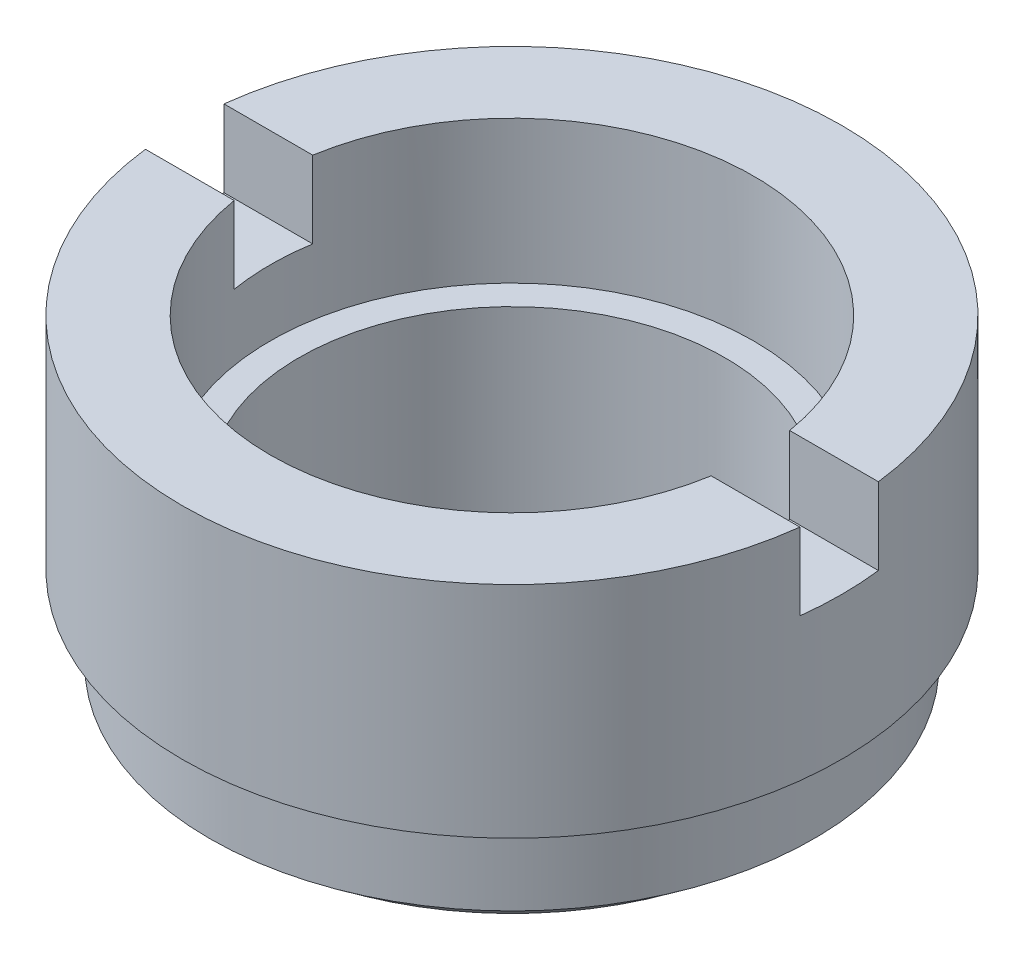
ISO-10303-21;
HEADER;
FILE_DESCRIPTION(('STEP AP214'),'2;1');
FILE_NAME('part.step','',(''),(''),'','','');
FILE_SCHEMA(('AUTOMOTIVE_DESIGN { 1 0 10303 214 1 1 1 1 }'));
ENDSEC;
DATA;
#1=APPLICATION_CONTEXT('core data for automotive mechanical design processes');
#2=APPLICATION_PROTOCOL_DEFINITION('international standard','automotive_design',2000,#1);
#3=PRODUCT_CONTEXT('',#1,'mechanical');
#4=PRODUCT('Part','Part','',(#3));
#5=PRODUCT_RELATED_PRODUCT_CATEGORY('part','',(#4));
#6=PRODUCT_DEFINITION_FORMATION('','',#4);
#7=PRODUCT_DEFINITION_CONTEXT('part definition',#1,'design');
#8=PRODUCT_DEFINITION('design','',#6,#7);
#9=PRODUCT_DEFINITION_SHAPE('','',#8);
#10=(LENGTH_UNIT() NAMED_UNIT(*) SI_UNIT(.MILLI.,.METRE.));
#11=(NAMED_UNIT(*) PLANE_ANGLE_UNIT() SI_UNIT($,.RADIAN.));
#12=(NAMED_UNIT(*) SI_UNIT($,.STERADIAN.) SOLID_ANGLE_UNIT());
#13=UNCERTAINTY_MEASURE_WITH_UNIT(LENGTH_MEASURE(1.E-05),#10,'distance_accuracy_value','');
#14=(GEOMETRIC_REPRESENTATION_CONTEXT(3) GLOBAL_UNCERTAINTY_ASSIGNED_CONTEXT((#13)) GLOBAL_UNIT_ASSIGNED_CONTEXT((#10,
#11,#12)) REPRESENTATION_CONTEXT('',''));
#15=CARTESIAN_POINT('',(0.,0.,0.));
#16=DIRECTION('',(0.,0.,1.));
#17=DIRECTION('',(1.,0.,0.));
#18=AXIS2_PLACEMENT_3D('',#15,#16,#17);
#19=CARTESIAN_POINT('',(-5.99999999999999,6.00000000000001,0.));
#20=DIRECTION('',(0.,1.,0.));
#21=DIRECTION('',(0.,0.,1.));
#22=AXIS2_PLACEMENT_3D('',#19,#20,#21);
#23=PLANE('',#22);
#24=DIRECTION('',(-1.,0.,0.));
#25=VECTOR('',#24,1.);
#26=CARTESIAN_POINT('',(7.50000000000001,6.00000000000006,-0.715000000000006));
#27=LINE('',#26,#25);
#28=CARTESIAN_POINT('',(5.95724558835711,6.00000000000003,-0.715000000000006));
#29=VERTEX_POINT('',#28);
#30=CARTESIAN_POINT('',(4.34151759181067,6.,-0.715000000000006));
#31=VERTEX_POINT('',#30);
#32=EDGE_CURVE('E152',#29,#31,#27,.T.);
#33=ORIENTED_EDGE('',*,*,#32,.F.);
#34=CARTESIAN_POINT('',(0.,6.,0.));
#35=DIRECTION('',(0.,1.,0.));
#36=DIRECTION('',(0.,0.,1.));
#37=AXIS2_PLACEMENT_3D('',#34,#35,#36);
#38=CIRCLE('',#37,5.99999999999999);
#39=CARTESIAN_POINT('',(-5.95724558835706,6.,-0.71500000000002));
#40=VERTEX_POINT('',#39);
#41=EDGE_CURVE('E119',#29,#40,#38,.T.);
#42=ORIENTED_EDGE('',*,*,#41,.T.);
#43=CARTESIAN_POINT('',(-4.34151759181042,5.99999999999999,-0.715000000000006));
#44=VERTEX_POINT('',#43);
#45=EDGE_CURVE('E111',#44,#40,#27,.T.);
#46=ORIENTED_EDGE('',*,*,#45,.F.);
#47=CARTESIAN_POINT('',(0.,6.,0.));
#48=DIRECTION('',(0.,1.,0.));
#49=DIRECTION('',(0.,0.,1.));
#50=AXIS2_PLACEMENT_3D('',#47,#48,#49);
#51=CIRCLE('',#50,4.4);
#52=EDGE_CURVE('E120',#31,#44,#51,.T.);
#53=ORIENTED_EDGE('',*,*,#52,.F.);
#54=EDGE_LOOP('',(#33,#42,#46,#53));
#55=FACE_BOUND('',#54,.T.);
#56=ADVANCED_FACE('F29',(#55),#23,.T.);
#57=CARTESIAN_POINT('',(0.,0.499999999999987,0.));
#58=DIRECTION('',(0.,1.,0.));
#59=DIRECTION('',(0.,0.,1.));
#60=AXIS2_PLACEMENT_3D('',#57,#58,#59);
#61=CONICAL_SURFACE('',#60,5.49999999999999,0.91510070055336);
#62=CARTESIAN_POINT('',(0.,0.,0.));
#63=DIRECTION('',(0.,1.,0.));
#64=DIRECTION('',(0.,0.,1.));
#65=AXIS2_PLACEMENT_3D('',#62,#63,#64);
#66=CIRCLE('',#65,4.84999999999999);
#67=CARTESIAN_POINT('',(0.,0.,4.85));
#68=VERTEX_POINT('',#67);
#69=EDGE_CURVE('E168',#68,#68,#66,.T.);
#70=ORIENTED_EDGE('',*,*,#69,.T.);
#71=EDGE_LOOP('',(#70));
#72=FACE_BOUND('',#71,.T.);
#73=CARTESIAN_POINT('',(0.,0.499999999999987,0.));
#74=DIRECTION('',(0.,1.,0.));
#75=DIRECTION('',(0.,0.,1.));
#76=AXIS2_PLACEMENT_3D('',#73,#74,#75);
#77=CIRCLE('',#76,5.49999999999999);
#78=CARTESIAN_POINT('',(0.,0.499999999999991,5.5));
#79=VERTEX_POINT('',#78);
#80=EDGE_CURVE('E133',#79,#79,#77,.T.);
#81=ORIENTED_EDGE('',*,*,#80,.F.);
#82=EDGE_LOOP('',(#81));
#83=FACE_BOUND('',#82,.T.);
#84=ADVANCED_FACE('F31',(#72,#83),#61,.T.);
#85=CARTESIAN_POINT('',(1.2490009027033E-13,50.,0.));
#86=DIRECTION('',(0.,1.,0.));
#87=DIRECTION('',(0.,0.,1.));
#88=AXIS2_PLACEMENT_3D('',#85,#86,#87);
#89=CYLINDRICAL_SURFACE('',#88,5.49999999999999);
#90=ORIENTED_EDGE('',*,*,#80,.T.);
#91=EDGE_LOOP('',(#90));
#92=FACE_BOUND('',#91,.T.);
#93=CARTESIAN_POINT('',(0.,2.,0.));
#94=DIRECTION('',(0.,1.,0.));
#95=DIRECTION('',(0.,0.,1.));
#96=AXIS2_PLACEMENT_3D('',#93,#94,#95);
#97=CIRCLE('',#96,5.49999999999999);
#98=CARTESIAN_POINT('',(0.,2.,5.49999999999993));
#99=VERTEX_POINT('',#98);
#100=EDGE_CURVE('E130',#99,#99,#97,.T.);
#101=ORIENTED_EDGE('',*,*,#100,.F.);
#102=EDGE_LOOP('',(#101));
#103=FACE_BOUND('',#102,.T.);
#104=ADVANCED_FACE('F212',(#92,#103),#89,.T.);
#105=CARTESIAN_POINT('',(-5.49999999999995,1.99999999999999,0.));
#106=DIRECTION('',(0.,-1.,0.));
#107=DIRECTION('',(0.,0.,-1.));
#108=AXIS2_PLACEMENT_3D('',#105,#106,#107);
#109=PLANE('',#108);
#110=ORIENTED_EDGE('',*,*,#100,.T.);
#111=EDGE_LOOP('',(#110));
#112=FACE_BOUND('',#111,.T.);
#113=CARTESIAN_POINT('',(0.,2.,0.));
#114=DIRECTION('',(0.,1.,0.));
#115=DIRECTION('',(0.,0.,1.));
#116=AXIS2_PLACEMENT_3D('',#113,#114,#115);
#117=CIRCLE('',#116,5.99999999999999);
#118=CARTESIAN_POINT('',(0.,2.,5.99999999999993));
#119=VERTEX_POINT('',#118);
#120=EDGE_CURVE('E123',#119,#119,#117,.T.);
#121=ORIENTED_EDGE('',*,*,#120,.F.);
#122=EDGE_LOOP('',(#121));
#123=FACE_BOUND('',#122,.T.);
#124=ADVANCED_FACE('F222',(#112,#123),#109,.T.);
#125=CARTESIAN_POINT('',(1.2490009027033E-13,50.,0.));
#126=DIRECTION('',(0.,1.,0.));
#127=DIRECTION('',(0.,0.,1.));
#128=AXIS2_PLACEMENT_3D('',#125,#126,#127);
#129=CYLINDRICAL_SURFACE('',#128,5.99999999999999);
#130=DIRECTION('',(0.,1.,0.));
#131=VECTOR('',#130,1.);
#132=CARTESIAN_POINT('',(-5.95724558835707,50.,-0.715000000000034));
#133=LINE('',#132,#131);
#134=CARTESIAN_POINT('',(-5.95724558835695,4.6,-0.715000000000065));
#135=VERTEX_POINT('',#134);
#136=EDGE_CURVE('E171',#40,#135,#133,.F.);
#137=ORIENTED_EDGE('',*,*,#136,.F.);
#138=ORIENTED_EDGE('',*,*,#41,.F.);
#139=DIRECTION('',(0.,1.,0.));
#140=VECTOR('',#139,1.);
#141=CARTESIAN_POINT('',(5.95724558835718,49.9999999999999,-0.715000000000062));
#142=LINE('',#141,#140);
#143=CARTESIAN_POINT('',(5.95724558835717,4.60000000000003,-0.715000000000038));
#144=VERTEX_POINT('',#143);
#145=EDGE_CURVE('E173',#144,#29,#142,.T.);
#146=ORIENTED_EDGE('',*,*,#145,.F.);
#147=CARTESIAN_POINT('',(0.,4.6,0.));
#148=DIRECTION('',(0.,-1.,0.));
#149=DIRECTION('',(0.,0.,-1.));
#150=AXIS2_PLACEMENT_3D('',#147,#148,#149);
#151=CIRCLE('',#150,5.99999999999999);
#152=CARTESIAN_POINT('',(5.95724558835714,4.60000000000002,0.714999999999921));
#153=VERTEX_POINT('',#152);
#154=EDGE_CURVE('E176',#153,#144,#151,.F.);
#155=ORIENTED_EDGE('',*,*,#154,.F.);
#156=DIRECTION('',(0.,1.,0.));
#157=VECTOR('',#156,1.);
#158=CARTESIAN_POINT('',(5.95724558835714,49.9999999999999,0.714999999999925));
#159=LINE('',#158,#157);
#160=CARTESIAN_POINT('',(5.95724558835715,6.00000000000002,0.715000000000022));
#161=VERTEX_POINT('',#160);
#162=EDGE_CURVE('E100',#161,#153,#159,.F.);
#163=ORIENTED_EDGE('',*,*,#162,.F.);
#164=CARTESIAN_POINT('',(-5.95724558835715,5.99999999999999,0.714999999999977));
#165=VERTEX_POINT('',#164);
#166=EDGE_CURVE('E108',#165,#161,#38,.T.);
#167=ORIENTED_EDGE('',*,*,#166,.F.);
#168=DIRECTION('',(0.,1.,0.));
#169=VECTOR('',#168,1.);
#170=CARTESIAN_POINT('',(-5.95724558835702,50.,0.71499999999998));
#171=LINE('',#170,#169);
#172=CARTESIAN_POINT('',(-5.95724558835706,4.59999999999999,0.71499999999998));
#173=VERTEX_POINT('',#172);
#174=EDGE_CURVE('E92',#173,#165,#171,.T.);
#175=ORIENTED_EDGE('',*,*,#174,.F.);
#176=EDGE_CURVE('E101',#135,#173,#151,.F.);
#177=ORIENTED_EDGE('',*,*,#176,.F.);
#178=EDGE_LOOP('',(#137,#138,#146,#155,#163,#167,#175,#177));
#179=FACE_BOUND('',#178,.T.);
#180=ORIENTED_EDGE('',*,*,#120,.T.);
#181=EDGE_LOOP('',(#180));
#182=FACE_BOUND('',#181,.T.);
#183=ADVANCED_FACE('F116',(#179,#182),#129,.T.);
#184=DIRECTION('',(1.,0.,0.));
#185=VECTOR('',#184,1.);
#186=CARTESIAN_POINT('',(7.50000000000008,6.,0.715000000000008));
#187=LINE('',#186,#185);
#188=CARTESIAN_POINT('',(-4.34151759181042,5.99999999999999,0.71499999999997));
#189=VERTEX_POINT('',#188);
#190=EDGE_CURVE('E95',#165,#189,#187,.T.);
#191=ORIENTED_EDGE('',*,*,#190,.F.);
#192=ORIENTED_EDGE('',*,*,#166,.T.);
#193=CARTESIAN_POINT('',(4.34151759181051,6.00000000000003,0.714999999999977));
#194=VERTEX_POINT('',#193);
#195=EDGE_CURVE('E112',#194,#161,#187,.T.);
#196=ORIENTED_EDGE('',*,*,#195,.F.);
#197=EDGE_CURVE('E110',#189,#194,#51,.T.);
#198=ORIENTED_EDGE('',*,*,#197,.F.);
#199=EDGE_LOOP('',(#191,#192,#196,#198));
#200=FACE_BOUND('',#199,.T.);
#201=ADVANCED_FACE('F106',(#200),#23,.T.);
#202=CARTESIAN_POINT('',(1.2490009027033E-13,50.,0.));
#203=DIRECTION('',(0.,1.,0.));
#204=DIRECTION('',(0.,0.,1.));
#205=AXIS2_PLACEMENT_3D('',#202,#203,#204);
#206=CYLINDRICAL_SURFACE('',#205,4.4);
#207=DIRECTION('',(0.,1.,0.));
#208=VECTOR('',#207,1.);
#209=CARTESIAN_POINT('',(4.34151759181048,50.0000000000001,-0.715000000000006));
#210=LINE('',#209,#208);
#211=CARTESIAN_POINT('',(4.34151759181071,4.6,-0.715000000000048));
#212=VERTEX_POINT('',#211);
#213=EDGE_CURVE('E11',#31,#212,#210,.F.);
#214=ORIENTED_EDGE('',*,*,#213,.F.);
#215=ORIENTED_EDGE('',*,*,#52,.T.);
#216=DIRECTION('',(0.,1.,0.));
#217=VECTOR('',#216,1.);
#218=CARTESIAN_POINT('',(-4.34151759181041,50.,-0.715000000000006));
#219=LINE('',#218,#217);
#220=CARTESIAN_POINT('',(-4.34151759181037,4.59999999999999,-0.715000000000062));
#221=VERTEX_POINT('',#220);
#222=EDGE_CURVE('E141',#221,#44,#219,.T.);
#223=ORIENTED_EDGE('',*,*,#222,.F.);
#224=CARTESIAN_POINT('',(0.,4.6,0.));
#225=DIRECTION('',(0.,-1.,0.));
#226=DIRECTION('',(0.,0.,-1.));
#227=AXIS2_PLACEMENT_3D('',#224,#225,#226);
#228=CIRCLE('',#227,4.4);
#229=CARTESIAN_POINT('',(-4.34151759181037,4.59999999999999,0.714999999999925));
#230=VERTEX_POINT('',#229);
#231=EDGE_CURVE('E136',#230,#221,#228,.T.);
#232=ORIENTED_EDGE('',*,*,#231,.F.);
#233=DIRECTION('',(0.,1.,0.));
#234=VECTOR('',#233,1.);
#235=CARTESIAN_POINT('',(-4.34151759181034,50.,0.714999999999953));
#236=LINE('',#235,#234);
#237=EDGE_CURVE('E138',#189,#230,#236,.F.);
#238=ORIENTED_EDGE('',*,*,#237,.F.);
#239=ORIENTED_EDGE('',*,*,#197,.T.);
#240=DIRECTION('',(0.,1.,0.));
#241=VECTOR('',#240,1.);
#242=CARTESIAN_POINT('',(4.34151759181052,49.9999999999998,0.714999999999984));
#243=LINE('',#242,#241);
#244=CARTESIAN_POINT('',(4.34151759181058,4.60000000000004,0.714999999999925));
#245=VERTEX_POINT('',#244);
#246=EDGE_CURVE('E37',#245,#194,#243,.T.);
#247=ORIENTED_EDGE('',*,*,#246,.F.);
#248=EDGE_CURVE('E139',#212,#245,#228,.T.);
#249=ORIENTED_EDGE('',*,*,#248,.F.);
#250=EDGE_LOOP('',(#214,#215,#223,#232,#238,#239,#247,#249));
#251=FACE_BOUND('',#250,.T.);
#252=CARTESIAN_POINT('',(0.,3.4,0.));
#253=DIRECTION('',(0.,1.,0.));
#254=DIRECTION('',(0.,0.,1.));
#255=AXIS2_PLACEMENT_3D('',#252,#253,#254);
#256=CIRCLE('',#255,4.4);
#257=CARTESIAN_POINT('',(0.,3.4,4.39999999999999));
#258=VERTEX_POINT('',#257);
#259=EDGE_CURVE('E157',#258,#258,#256,.T.);
#260=ORIENTED_EDGE('',*,*,#259,.F.);
#261=EDGE_LOOP('',(#260));
#262=FACE_BOUND('',#261,.T.);
#263=ADVANCED_FACE('F154',(#251,#262),#206,.F.);
#264=CARTESIAN_POINT('',(-4.39999999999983,3.39999999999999,0.));
#265=DIRECTION('',(0.,1.,0.));
#266=DIRECTION('',(0.,0.,1.));
#267=AXIS2_PLACEMENT_3D('',#264,#265,#266);
#268=PLANE('',#267);
#269=ORIENTED_EDGE('',*,*,#259,.T.);
#270=EDGE_LOOP('',(#269));
#271=FACE_BOUND('',#270,.T.);
#272=CARTESIAN_POINT('',(0.,3.4,0.));
#273=DIRECTION('',(0.,1.,0.));
#274=DIRECTION('',(0.,0.,1.));
#275=AXIS2_PLACEMENT_3D('',#272,#273,#274);
#276=CIRCLE('',#275,3.87499999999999);
#277=CARTESIAN_POINT('',(0.,3.4,3.87499999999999));
#278=VERTEX_POINT('',#277);
#279=EDGE_CURVE('E159',#278,#278,#276,.T.);
#280=ORIENTED_EDGE('',*,*,#279,.F.);
#281=EDGE_LOOP('',(#280));
#282=FACE_BOUND('',#281,.T.);
#283=ADVANCED_FACE('F221',(#271,#282),#268,.T.);
#284=CARTESIAN_POINT('',(1.2490009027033E-13,50.,0.));
#285=DIRECTION('',(0.,1.,0.));
#286=DIRECTION('',(0.,0.,1.));
#287=AXIS2_PLACEMENT_3D('',#284,#285,#286);
#288=CYLINDRICAL_SURFACE('',#287,3.87499999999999);
#289=ORIENTED_EDGE('',*,*,#279,.T.);
#290=EDGE_LOOP('',(#289));
#291=FACE_BOUND('',#290,.T.);
#292=CARTESIAN_POINT('',(0.,0.,0.));
#293=DIRECTION('',(0.,1.,0.));
#294=DIRECTION('',(0.,0.,1.));
#295=AXIS2_PLACEMENT_3D('',#292,#293,#294);
#296=CIRCLE('',#295,3.87499999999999);
#297=CARTESIAN_POINT('',(0.,0.,3.875));
#298=VERTEX_POINT('',#297);
#299=EDGE_CURVE('E163',#298,#298,#296,.T.);
#300=ORIENTED_EDGE('',*,*,#299,.F.);
#301=EDGE_LOOP('',(#300));
#302=FACE_BOUND('',#301,.T.);
#303=ADVANCED_FACE('F202',(#291,#302),#288,.F.);
#304=CARTESIAN_POINT('',(-3.87499999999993,0.,0.));
#305=DIRECTION('',(0.,-1.,0.));
#306=DIRECTION('',(0.,0.,-1.));
#307=AXIS2_PLACEMENT_3D('',#304,#305,#306);
#308=PLANE('',#307);
#309=ORIENTED_EDGE('',*,*,#299,.T.);
#310=EDGE_LOOP('',(#309));
#311=FACE_BOUND('',#310,.T.);
#312=ORIENTED_EDGE('',*,*,#69,.F.);
#313=EDGE_LOOP('',(#312));
#314=FACE_BOUND('',#313,.T.);
#315=ADVANCED_FACE('F195',(#311,#314),#308,.T.);
#316=CARTESIAN_POINT('',(-7.50000000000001,4.59999999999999,0.714999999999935));
#317=DIRECTION('',(0.,-1.,0.));
#318=DIRECTION('',(0.,0.,-1.));
#319=AXIS2_PLACEMENT_3D('',#316,#317,#318);
#320=PLANE('',#319);
#321=ORIENTED_EDGE('',*,*,#176,.T.);
#322=DIRECTION('',(1.,0.,0.));
#323=VECTOR('',#322,1.);
#324=CARTESIAN_POINT('',(7.50000000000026,4.6,0.714999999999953));
#325=LINE('',#324,#323);
#326=EDGE_CURVE('E51',#173,#230,#325,.T.);
#327=ORIENTED_EDGE('',*,*,#326,.T.);
#328=ORIENTED_EDGE('',*,*,#231,.T.);
#329=DIRECTION('',(-1.,0.,0.));
#330=VECTOR('',#329,1.);
#331=CARTESIAN_POINT('',(7.5000000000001,4.60000000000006,-0.715000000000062));
#332=LINE('',#331,#330);
#333=EDGE_CURVE('E178',#221,#135,#332,.T.);
#334=ORIENTED_EDGE('',*,*,#333,.T.);
#335=EDGE_LOOP('',(#321,#327,#328,#334));
#336=FACE_BOUND('',#335,.T.);
#337=ADVANCED_FACE('F193',(#336),#320,.F.);
#338=CARTESIAN_POINT('',(7.50000000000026,4.6,0.714999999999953));
#339=DIRECTION('',(0.,0.,1.));
#340=DIRECTION('',(1.,0.,0.));
#341=AXIS2_PLACEMENT_3D('',#338,#339,#340);
#342=PLANE('',#341);
#343=ORIENTED_EDGE('',*,*,#174,.T.);
#344=ORIENTED_EDGE('',*,*,#190,.T.);
#345=ORIENTED_EDGE('',*,*,#237,.T.);
#346=ORIENTED_EDGE('',*,*,#326,.F.);
#347=EDGE_LOOP('',(#343,#344,#345,#346));
#348=FACE_BOUND('',#347,.T.);
#349=ADVANCED_FACE('F94',(#348),#342,.F.);
#350=CARTESIAN_POINT('',(7.5000000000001,4.60000000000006,-0.715000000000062));
#351=DIRECTION('',(0.,0.,-1.));
#352=DIRECTION('',(-1.,0.,0.));
#353=AXIS2_PLACEMENT_3D('',#350,#351,#352);
#354=PLANE('',#353);
#355=ORIENTED_EDGE('',*,*,#136,.T.);
#356=ORIENTED_EDGE('',*,*,#333,.F.);
#357=ORIENTED_EDGE('',*,*,#222,.T.);
#358=ORIENTED_EDGE('',*,*,#45,.T.);
#359=EDGE_LOOP('',(#355,#356,#357,#358));
#360=FACE_BOUND('',#359,.T.);
#361=ADVANCED_FACE('F192',(#360),#354,.F.);
#362=ORIENTED_EDGE('',*,*,#162,.T.);
#363=EDGE_CURVE('E148',#245,#153,#325,.T.);
#364=ORIENTED_EDGE('',*,*,#363,.F.);
#365=ORIENTED_EDGE('',*,*,#246,.T.);
#366=ORIENTED_EDGE('',*,*,#195,.T.);
#367=EDGE_LOOP('',(#362,#364,#365,#366));
#368=FACE_BOUND('',#367,.T.);
#369=ADVANCED_FACE('F151',(#368),#342,.F.);
#370=ORIENTED_EDGE('',*,*,#154,.T.);
#371=EDGE_CURVE('E44',#144,#212,#332,.T.);
#372=ORIENTED_EDGE('',*,*,#371,.T.);
#373=ORIENTED_EDGE('',*,*,#248,.T.);
#374=ORIENTED_EDGE('',*,*,#363,.T.);
#375=EDGE_LOOP('',(#370,#372,#373,#374));
#376=FACE_BOUND('',#375,.T.);
#377=ADVANCED_FACE('F147',(#376),#320,.F.);
#378=ORIENTED_EDGE('',*,*,#145,.T.);
#379=ORIENTED_EDGE('',*,*,#32,.T.);
#380=ORIENTED_EDGE('',*,*,#213,.T.);
#381=ORIENTED_EDGE('',*,*,#371,.F.);
#382=EDGE_LOOP('',(#378,#379,#380,#381));
#383=FACE_BOUND('',#382,.T.);
#384=ADVANCED_FACE('F185',(#383),#354,.F.);
#385=CLOSED_SHELL('',(#56,#84,#104,#124,#183,#201,#263,#283,#303,#315,#337,#349,#361,#369,#377,#384));
#386=MANIFOLD_SOLID_BREP('B2',#385);
#387=ADVANCED_BREP_SHAPE_REPRESENTATION('',(#18,#386),#14);
#388=SHAPE_DEFINITION_REPRESENTATION(#9,#387);
ENDSEC;
END-ISO-10303-21;
